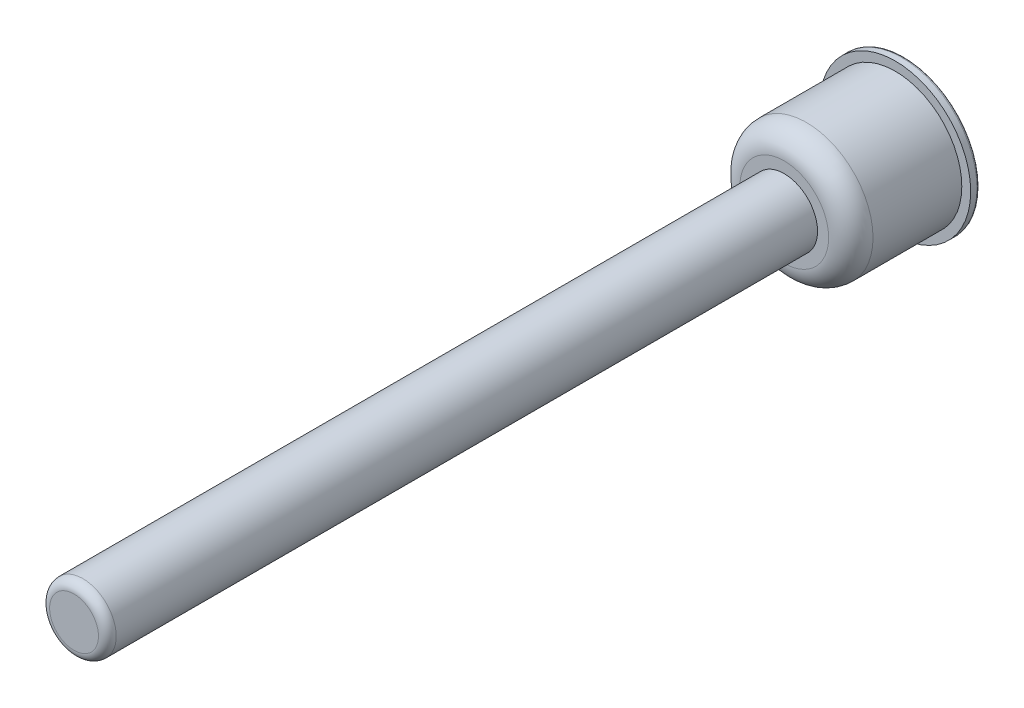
ISO-10303-21;
HEADER;
FILE_DESCRIPTION(('STEP AP214'),'2;1');
FILE_NAME('part.step','',(''),(''),'','','');
FILE_SCHEMA(('AUTOMOTIVE_DESIGN { 1 0 10303 214 1 1 1 1 }'));
ENDSEC;
DATA;
#1=APPLICATION_CONTEXT('core data for automotive mechanical design processes');
#2=APPLICATION_PROTOCOL_DEFINITION('international standard','automotive_design',2000,#1);
#3=PRODUCT_CONTEXT('',#1,'mechanical');
#4=PRODUCT('Part','Part','',(#3));
#5=PRODUCT_RELATED_PRODUCT_CATEGORY('part','',(#4));
#6=PRODUCT_DEFINITION_FORMATION('','',#4);
#7=PRODUCT_DEFINITION_CONTEXT('part definition',#1,'design');
#8=PRODUCT_DEFINITION('design','',#6,#7);
#9=PRODUCT_DEFINITION_SHAPE('','',#8);
#10=(LENGTH_UNIT() NAMED_UNIT(*) SI_UNIT(.MILLI.,.METRE.));
#11=(NAMED_UNIT(*) PLANE_ANGLE_UNIT() SI_UNIT($,.RADIAN.));
#12=(NAMED_UNIT(*) SI_UNIT($,.STERADIAN.) SOLID_ANGLE_UNIT());
#13=UNCERTAINTY_MEASURE_WITH_UNIT(LENGTH_MEASURE(1.E-05),#10,'distance_accuracy_value','');
#14=(GEOMETRIC_REPRESENTATION_CONTEXT(3) GLOBAL_UNCERTAINTY_ASSIGNED_CONTEXT((#13)) GLOBAL_UNIT_ASSIGNED_CONTEXT((#10,
#11,#12)) REPRESENTATION_CONTEXT('',''));
#15=CARTESIAN_POINT('',(0.,0.,0.));
#16=DIRECTION('',(0.,0.,1.));
#17=DIRECTION('',(1.,0.,0.));
#18=AXIS2_PLACEMENT_3D('',#15,#16,#17);
#19=CARTESIAN_POINT('',(0.,0.,0.));
#20=DIRECTION('',(0.,0.,1.));
#21=DIRECTION('',(1.,0.,0.));
#22=AXIS2_PLACEMENT_3D('',#19,#20,#21);
#23=PLANE('',#22);
#24=CARTESIAN_POINT('',(0.,0.,0.));
#25=DIRECTION('',(0.,0.,1.));
#26=DIRECTION('',(1.,0.,0.));
#27=AXIS2_PLACEMENT_3D('',#24,#25,#26);
#28=CIRCLE('',#27,20.828);
#29=CARTESIAN_POINT('',(20.828,0.,0.));
#30=VERTEX_POINT('',#29);
#31=EDGE_CURVE('E130',#30,#30,#28,.F.);
#32=ORIENTED_EDGE('',*,*,#31,.T.);
#33=EDGE_LOOP('',(#32));
#34=FACE_BOUND('',#33,.T.);
#35=DIRECTION('',(0.,1.,0.));
#36=VECTOR('',#35,1.);
#37=CARTESIAN_POINT('',(6.35,6.35,0.));
#38=LINE('',#37,#36);
#39=CARTESIAN_POINT('',(6.35,-6.35,0.));
#40=VERTEX_POINT('',#39);
#41=CARTESIAN_POINT('',(6.35,6.35,0.));
#42=VERTEX_POINT('',#41);
#43=EDGE_CURVE('E50',#40,#42,#38,.T.);
#44=ORIENTED_EDGE('',*,*,#43,.T.);
#45=DIRECTION('',(-1.,0.,0.));
#46=VECTOR('',#45,1.);
#47=CARTESIAN_POINT('',(-6.35,6.35,0.));
#48=LINE('',#47,#46);
#49=CARTESIAN_POINT('',(-6.35,6.35,0.));
#50=VERTEX_POINT('',#49);
#51=EDGE_CURVE('E105',#42,#50,#48,.T.);
#52=ORIENTED_EDGE('',*,*,#51,.T.);
#53=DIRECTION('',(0.,-1.,0.));
#54=VECTOR('',#53,1.);
#55=CARTESIAN_POINT('',(-6.35,6.35,0.));
#56=LINE('',#55,#54);
#57=CARTESIAN_POINT('',(-6.35,-6.35,0.));
#58=VERTEX_POINT('',#57);
#59=EDGE_CURVE('E95',#50,#58,#56,.T.);
#60=ORIENTED_EDGE('',*,*,#59,.T.);
#61=DIRECTION('',(1.,0.,0.));
#62=VECTOR('',#61,1.);
#63=CARTESIAN_POINT('',(-6.35,-6.35,0.));
#64=LINE('',#63,#62);
#65=EDGE_CURVE('E108',#58,#40,#64,.T.);
#66=ORIENTED_EDGE('',*,*,#65,.T.);
#67=EDGE_LOOP('',(#44,#52,#60,#66));
#68=FACE_BOUND('',#67,.T.);
#69=ADVANCED_FACE('F35',(#34,#68),#23,.F.);
#70=CARTESIAN_POINT('',(0.,0.,2.54));
#71=DIRECTION('',(0.,0.,-1.));
#72=DIRECTION('',(-1.,0.,0.));
#73=AXIS2_PLACEMENT_3D('',#70,#71,#72);
#74=CYLINDRICAL_SURFACE('',#73,21.59);
#75=CARTESIAN_POINT('',(0.,0.,0.762));
#76=DIRECTION('',(0.,0.,1.));
#77=DIRECTION('',(1.,0.,0.));
#78=AXIS2_PLACEMENT_3D('',#75,#76,#77);
#79=CIRCLE('',#78,21.59);
#80=CARTESIAN_POINT('',(21.59,0.,0.762));
#81=VERTEX_POINT('',#80);
#82=EDGE_CURVE('E127',#81,#81,#79,.T.);
#83=ORIENTED_EDGE('',*,*,#82,.T.);
#84=EDGE_LOOP('',(#83));
#85=FACE_BOUND('',#84,.T.);
#86=CARTESIAN_POINT('',(0.,0.,2.54));
#87=DIRECTION('',(0.,0.,1.));
#88=DIRECTION('',(1.,0.,0.));
#89=AXIS2_PLACEMENT_3D('',#86,#87,#88);
#90=CIRCLE('',#89,21.59);
#91=CARTESIAN_POINT('',(21.59,0.,2.54));
#92=VERTEX_POINT('',#91);
#93=EDGE_CURVE('E114',#92,#92,#90,.T.);
#94=ORIENTED_EDGE('',*,*,#93,.F.);
#95=EDGE_LOOP('',(#94));
#96=FACE_BOUND('',#95,.T.);
#97=ADVANCED_FACE('F147',(#85,#96),#74,.T.);
#98=CARTESIAN_POINT('',(0.,0.,2.54));
#99=DIRECTION('',(0.,0.,1.));
#100=DIRECTION('',(1.,0.,0.));
#101=AXIS2_PLACEMENT_3D('',#98,#99,#100);
#102=PLANE('',#101);
#103=CARTESIAN_POINT('',(0.,0.,2.54));
#104=DIRECTION('',(0.,0.,1.));
#105=DIRECTION('',(1.,0.,0.));
#106=AXIS2_PLACEMENT_3D('',#103,#104,#105);
#107=CIRCLE('',#106,19.05);
#108=CARTESIAN_POINT('',(19.05,0.,2.54));
#109=VERTEX_POINT('',#108);
#110=EDGE_CURVE('E115',#109,#109,#107,.T.);
#111=ORIENTED_EDGE('',*,*,#110,.F.);
#112=EDGE_LOOP('',(#111));
#113=FACE_BOUND('',#112,.T.);
#114=ORIENTED_EDGE('',*,*,#93,.T.);
#115=EDGE_LOOP('',(#114));
#116=FACE_BOUND('',#115,.T.);
#117=ADVANCED_FACE('F153',(#113,#116),#102,.T.);
#118=CARTESIAN_POINT('',(0.,0.,34.29));
#119=DIRECTION('',(0.,0.,-1.));
#120=DIRECTION('',(-1.,0.,0.));
#121=AXIS2_PLACEMENT_3D('',#118,#119,#120);
#122=CYLINDRICAL_SURFACE('',#121,19.05);
#123=CARTESIAN_POINT('',(0.,0.,27.94));
#124=DIRECTION('',(0.,0.,1.));
#125=DIRECTION('',(1.,0.,0.));
#126=AXIS2_PLACEMENT_3D('',#123,#124,#125);
#127=CIRCLE('',#126,19.05);
#128=CARTESIAN_POINT('',(19.05,0.,27.94));
#129=VERTEX_POINT('',#128);
#130=EDGE_CURVE('E124',#129,#129,#127,.F.);
#131=ORIENTED_EDGE('',*,*,#130,.T.);
#132=EDGE_LOOP('',(#131));
#133=FACE_BOUND('',#132,.T.);
#134=ORIENTED_EDGE('',*,*,#110,.T.);
#135=EDGE_LOOP('',(#134));
#136=FACE_BOUND('',#135,.T.);
#137=ADVANCED_FACE('F175',(#133,#136),#122,.T.);
#138=CARTESIAN_POINT('',(0.,0.,34.29));
#139=DIRECTION('',(0.,0.,1.));
#140=DIRECTION('',(1.,0.,0.));
#141=AXIS2_PLACEMENT_3D('',#138,#139,#140);
#142=PLANE('',#141);
#143=CARTESIAN_POINT('',(0.,0.,34.29));
#144=DIRECTION('',(0.,0.,1.));
#145=DIRECTION('',(1.,0.,0.));
#146=AXIS2_PLACEMENT_3D('',#143,#144,#145);
#147=CIRCLE('',#146,12.7);
#148=CARTESIAN_POINT('',(12.7,0.,34.29));
#149=VERTEX_POINT('',#148);
#150=EDGE_CURVE('E121',#149,#149,#147,.T.);
#151=ORIENTED_EDGE('',*,*,#150,.T.);
#152=EDGE_LOOP('',(#151));
#153=FACE_BOUND('',#152,.T.);
#154=CARTESIAN_POINT('',(0.,0.,34.29));
#155=DIRECTION('',(0.,0.,1.));
#156=DIRECTION('',(1.,0.,0.));
#157=AXIS2_PLACEMENT_3D('',#154,#155,#156);
#158=CIRCLE('',#157,9.525);
#159=CARTESIAN_POINT('',(9.525,0.,34.29));
#160=VERTEX_POINT('',#159);
#161=EDGE_CURVE('E118',#160,#160,#158,.T.);
#162=ORIENTED_EDGE('',*,*,#161,.F.);
#163=EDGE_LOOP('',(#162));
#164=FACE_BOUND('',#163,.T.);
#165=ADVANCED_FACE('F171',(#153,#164),#142,.T.);
#166=CARTESIAN_POINT('',(6.35,6.35,19.05));
#167=DIRECTION('',(-1.,0.,0.));
#168=DIRECTION('',(0.,-1.,0.));
#169=AXIS2_PLACEMENT_3D('',#166,#167,#168);
#170=PLANE('',#169);
#171=ORIENTED_EDGE('',*,*,#43,.F.);
#172=DIRECTION('',(0.,0.,-1.));
#173=VECTOR('',#172,1.);
#174=CARTESIAN_POINT('',(6.35,-6.35,19.05));
#175=LINE('',#174,#173);
#176=CARTESIAN_POINT('',(6.35,-6.35,19.05));
#177=VERTEX_POINT('',#176);
#178=EDGE_CURVE('E100',#177,#40,#175,.T.);
#179=ORIENTED_EDGE('',*,*,#178,.F.);
#180=DIRECTION('',(0.,1.,0.));
#181=VECTOR('',#180,1.);
#182=CARTESIAN_POINT('',(6.35,6.35,19.05));
#183=LINE('',#182,#181);
#184=CARTESIAN_POINT('',(6.35,6.35,19.05));
#185=VERTEX_POINT('',#184);
#186=EDGE_CURVE('E91',#177,#185,#183,.T.);
#187=ORIENTED_EDGE('',*,*,#186,.T.);
#188=DIRECTION('',(0.,0.,-1.));
#189=VECTOR('',#188,1.);
#190=CARTESIAN_POINT('',(6.35,6.35,19.05));
#191=LINE('',#190,#189);
#192=EDGE_CURVE('E89',#185,#42,#191,.T.);
#193=ORIENTED_EDGE('',*,*,#192,.T.);
#194=EDGE_LOOP('',(#171,#179,#187,#193));
#195=FACE_BOUND('',#194,.T.);
#196=ADVANCED_FACE('F174',(#195),#170,.T.);
#197=CARTESIAN_POINT('',(-6.35,6.35,19.05));
#198=DIRECTION('',(0.,-1.,0.));
#199=DIRECTION('',(0.,0.,-1.));
#200=AXIS2_PLACEMENT_3D('',#197,#198,#199);
#201=PLANE('',#200);
#202=ORIENTED_EDGE('',*,*,#51,.F.);
#203=ORIENTED_EDGE('',*,*,#192,.F.);
#204=DIRECTION('',(-1.,0.,0.));
#205=VECTOR('',#204,1.);
#206=CARTESIAN_POINT('',(-6.35,6.35,19.05));
#207=LINE('',#206,#205);
#208=CARTESIAN_POINT('',(-6.35,6.35,19.05));
#209=VERTEX_POINT('',#208);
#210=EDGE_CURVE('E82',#185,#209,#207,.T.);
#211=ORIENTED_EDGE('',*,*,#210,.T.);
#212=DIRECTION('',(0.,0.,-1.));
#213=VECTOR('',#212,1.);
#214=CARTESIAN_POINT('',(-6.35,6.35,19.05));
#215=LINE('',#214,#213);
#216=EDGE_CURVE('E88',#209,#50,#215,.T.);
#217=ORIENTED_EDGE('',*,*,#216,.T.);
#218=EDGE_LOOP('',(#202,#203,#211,#217));
#219=FACE_BOUND('',#218,.T.);
#220=ADVANCED_FACE('F87',(#219),#201,.T.);
#221=CARTESIAN_POINT('',(-6.35,6.35,19.05));
#222=DIRECTION('',(1.,0.,0.));
#223=DIRECTION('',(0.,1.,0.));
#224=AXIS2_PLACEMENT_3D('',#221,#222,#223);
#225=PLANE('',#224);
#226=ORIENTED_EDGE('',*,*,#59,.F.);
#227=ORIENTED_EDGE('',*,*,#216,.F.);
#228=DIRECTION('',(0.,-1.,0.));
#229=VECTOR('',#228,1.);
#230=CARTESIAN_POINT('',(-6.35,6.35,19.05));
#231=LINE('',#230,#229);
#232=CARTESIAN_POINT('',(-6.35,-6.35,19.05));
#233=VERTEX_POINT('',#232);
#234=EDGE_CURVE('E90',#209,#233,#231,.T.);
#235=ORIENTED_EDGE('',*,*,#234,.T.);
#236=DIRECTION('',(0.,0.,-1.));
#237=VECTOR('',#236,1.);
#238=CARTESIAN_POINT('',(-6.35,-6.35,19.05));
#239=LINE('',#238,#237);
#240=EDGE_CURVE('E74',#233,#58,#239,.T.);
#241=ORIENTED_EDGE('',*,*,#240,.T.);
#242=EDGE_LOOP('',(#226,#227,#235,#241));
#243=FACE_BOUND('',#242,.T.);
#244=ADVANCED_FACE('F93',(#243),#225,.T.);
#245=CARTESIAN_POINT('',(-6.35,-6.35,19.05));
#246=DIRECTION('',(0.,1.,0.));
#247=DIRECTION('',(0.,0.,1.));
#248=AXIS2_PLACEMENT_3D('',#245,#246,#247);
#249=PLANE('',#248);
#250=ORIENTED_EDGE('',*,*,#65,.F.);
#251=ORIENTED_EDGE('',*,*,#240,.F.);
#252=DIRECTION('',(1.,0.,0.));
#253=VECTOR('',#252,1.);
#254=CARTESIAN_POINT('',(-6.35,-6.35,19.05));
#255=LINE('',#254,#253);
#256=EDGE_CURVE('E58',#233,#177,#255,.T.);
#257=ORIENTED_EDGE('',*,*,#256,.T.);
#258=ORIENTED_EDGE('',*,*,#178,.T.);
#259=EDGE_LOOP('',(#250,#251,#257,#258));
#260=FACE_BOUND('',#259,.T.);
#261=ADVANCED_FACE('F181',(#260),#249,.T.);
#262=CARTESIAN_POINT('',(0.,0.,19.05));
#263=DIRECTION('',(0.,0.,1.));
#264=DIRECTION('',(1.,0.,0.));
#265=AXIS2_PLACEMENT_3D('',#262,#263,#264);
#266=PLANE('',#265);
#267=ORIENTED_EDGE('',*,*,#186,.F.);
#268=ORIENTED_EDGE('',*,*,#256,.F.);
#269=ORIENTED_EDGE('',*,*,#234,.F.);
#270=ORIENTED_EDGE('',*,*,#210,.F.);
#271=EDGE_LOOP('',(#267,#268,#269,#270));
#272=FACE_BOUND('',#271,.T.);
#273=ADVANCED_FACE('F98',(#272),#266,.F.);
#274=CARTESIAN_POINT('',(0.,0.,237.49));
#275=DIRECTION('',(0.,0.,-1.));
#276=DIRECTION('',(-1.,0.,0.));
#277=AXIS2_PLACEMENT_3D('',#274,#275,#276);
#278=CYLINDRICAL_SURFACE('',#277,9.525);
#279=CARTESIAN_POINT('',(0.,0.,234.95));
#280=DIRECTION('',(0.,0.,1.));
#281=DIRECTION('',(1.,0.,0.));
#282=AXIS2_PLACEMENT_3D('',#279,#280,#281);
#283=CIRCLE('',#282,9.525);
#284=CARTESIAN_POINT('',(9.525,0.,234.95));
#285=VERTEX_POINT('',#284);
#286=EDGE_CURVE('E11',#285,#285,#283,.F.);
#287=ORIENTED_EDGE('',*,*,#286,.T.);
#288=EDGE_LOOP('',(#287));
#289=FACE_BOUND('',#288,.T.);
#290=ORIENTED_EDGE('',*,*,#161,.T.);
#291=EDGE_LOOP('',(#290));
#292=FACE_BOUND('',#291,.T.);
#293=ADVANCED_FACE('F165',(#289,#292),#278,.T.);
#294=CARTESIAN_POINT('',(0.,0.,237.49));
#295=DIRECTION('',(0.,0.,1.));
#296=DIRECTION('',(1.,0.,0.));
#297=AXIS2_PLACEMENT_3D('',#294,#295,#296);
#298=PLANE('',#297);
#299=CARTESIAN_POINT('',(0.,0.,237.49));
#300=DIRECTION('',(0.,0.,1.));
#301=DIRECTION('',(1.,0.,0.));
#302=AXIS2_PLACEMENT_3D('',#299,#300,#301);
#303=CIRCLE('',#302,6.985);
#304=CARTESIAN_POINT('',(6.985,0.,237.49));
#305=VERTEX_POINT('',#304);
#306=EDGE_CURVE('E43',#305,#305,#303,.T.);
#307=ORIENTED_EDGE('',*,*,#306,.T.);
#308=EDGE_LOOP('',(#307));
#309=FACE_BOUND('',#308,.T.);
#310=ADVANCED_FACE('F135',(#309),#298,.T.);
#311=CARTESIAN_POINT('',(0.,0.,27.94));
#312=DIRECTION('',(0.,0.,1.));
#313=DIRECTION('',(1.,0.,0.));
#314=AXIS2_PLACEMENT_3D('',#311,#312,#313);
#315=TOROIDAL_SURFACE('',#314,12.7,6.35);
#316=ORIENTED_EDGE('',*,*,#130,.F.);
#317=EDGE_LOOP('',(#316));
#318=FACE_BOUND('',#317,.T.);
#319=ORIENTED_EDGE('',*,*,#150,.F.);
#320=EDGE_LOOP('',(#319));
#321=FACE_BOUND('',#320,.T.);
#322=ADVANCED_FACE('F143',(#318,#321),#315,.T.);
#323=CARTESIAN_POINT('',(0.,0.,0.762));
#324=DIRECTION('',(0.,0.,1.));
#325=DIRECTION('',(1.,0.,0.));
#326=AXIS2_PLACEMENT_3D('',#323,#324,#325);
#327=TOROIDAL_SURFACE('',#326,20.828,0.762);
#328=ORIENTED_EDGE('',*,*,#31,.F.);
#329=EDGE_LOOP('',(#328));
#330=FACE_BOUND('',#329,.T.);
#331=ORIENTED_EDGE('',*,*,#82,.F.);
#332=EDGE_LOOP('',(#331));
#333=FACE_BOUND('',#332,.T.);
#334=ADVANCED_FACE('F138',(#330,#333),#327,.T.);
#335=CARTESIAN_POINT('',(0.,0.,234.95));
#336=DIRECTION('',(0.,0.,1.));
#337=DIRECTION('',(1.,0.,0.));
#338=AXIS2_PLACEMENT_3D('',#335,#336,#337);
#339=TOROIDAL_SURFACE('',#338,6.985,2.54);
#340=ORIENTED_EDGE('',*,*,#286,.F.);
#341=EDGE_LOOP('',(#340));
#342=FACE_BOUND('',#341,.T.);
#343=ORIENTED_EDGE('',*,*,#306,.F.);
#344=EDGE_LOOP('',(#343));
#345=FACE_BOUND('',#344,.T.);
#346=ADVANCED_FACE('F37',(#342,#345),#339,.T.);
#347=CLOSED_SHELL('',(#69,#97,#117,#137,#165,#196,#220,#244,#261,#273,#293,#310,#322,#334,#346));
#348=MANIFOLD_SOLID_BREP('B2',#347);
#349=ADVANCED_BREP_SHAPE_REPRESENTATION('',(#18,#348),#14);
#350=SHAPE_DEFINITION_REPRESENTATION(#9,#349);
ENDSEC;
END-ISO-10303-21;
